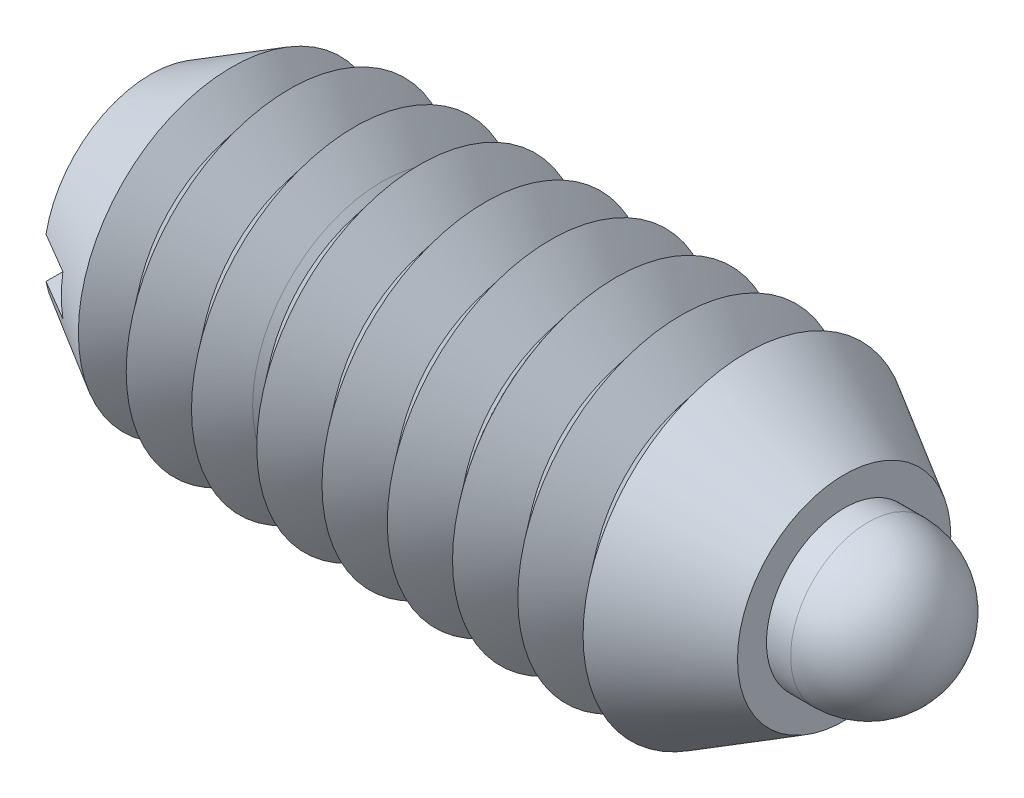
ISO-10303-21;
HEADER;
FILE_DESCRIPTION(('STEP AP214'),'2;1');
FILE_NAME('part.step','',(''),(''),'','','');
FILE_SCHEMA(('AUTOMOTIVE_DESIGN { 1 0 10303 214 1 1 1 1 }'));
ENDSEC;
DATA;
#1=APPLICATION_CONTEXT('core data for automotive mechanical design processes');
#2=APPLICATION_PROTOCOL_DEFINITION('international standard','automotive_design',2000,#1);
#3=PRODUCT_CONTEXT('',#1,'mechanical');
#4=PRODUCT('Part','Part','',(#3));
#5=PRODUCT_RELATED_PRODUCT_CATEGORY('part','',(#4));
#6=PRODUCT_DEFINITION_FORMATION('','',#4);
#7=PRODUCT_DEFINITION_CONTEXT('part definition',#1,'design');
#8=PRODUCT_DEFINITION('design','',#6,#7);
#9=PRODUCT_DEFINITION_SHAPE('','',#8);
#10=(LENGTH_UNIT() NAMED_UNIT(*) SI_UNIT(.MILLI.,.METRE.));
#11=(NAMED_UNIT(*) PLANE_ANGLE_UNIT() SI_UNIT($,.RADIAN.));
#12=(NAMED_UNIT(*) SI_UNIT($,.STERADIAN.) SOLID_ANGLE_UNIT());
#13=UNCERTAINTY_MEASURE_WITH_UNIT(LENGTH_MEASURE(1.E-05),#10,'distance_accuracy_value','');
#14=(GEOMETRIC_REPRESENTATION_CONTEXT(3) GLOBAL_UNCERTAINTY_ASSIGNED_CONTEXT((#13)) GLOBAL_UNIT_ASSIGNED_CONTEXT((#10,
#11,#12)) REPRESENTATION_CONTEXT('',''));
#15=CARTESIAN_POINT('',(0.,0.,0.));
#16=DIRECTION('',(0.,0.,1.));
#17=DIRECTION('',(1.,0.,0.));
#18=AXIS2_PLACEMENT_3D('',#15,#16,#17);
#19=CARTESIAN_POINT('',(10.01776,0.,0.));
#20=DIRECTION('',(-1.,0.,0.));
#21=DIRECTION('',(0.,-0.719424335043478,-0.694570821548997));
#22=AXIS2_PLACEMENT_3D('',#19,#20,#21);
#23=PLANE('',#22);
#24=CARTESIAN_POINT('',(10.01776,0.,0.));
#25=DIRECTION('',(1.,0.,0.));
#26=DIRECTION('',(0.,0.719424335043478,0.694570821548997));
#27=AXIS2_PLACEMENT_3D('',#24,#25,#26);
#28=CIRCLE('',#27,1.5113);
#29=CARTESIAN_POINT('',(10.01776,1.08726599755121,1.049704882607));
#30=VERTEX_POINT('',#29);
#31=EDGE_CURVE('P0_E10',#30,#30,#28,.T.);
#32=ORIENTED_EDGE('',*,*,#31,.F.);
#33=EDGE_LOOP('',(#32));
#34=FACE_BOUND('',#33,.T.);
#35=ADVANCED_FACE('P0_F14',(#34),#23,.T.);
#36=CARTESIAN_POINT('',(10.32002,0.,0.));
#37=DIRECTION('',(1.,0.,0.));
#38=DIRECTION('',(0.,0.719424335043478,0.694570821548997));
#39=AXIS2_PLACEMENT_3D('',#36,#37,#38);
#40=CONICAL_SURFACE('',#39,1.81356,0.78539816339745);
#41=ORIENTED_EDGE('',*,*,#31,.T.);
#42=EDGE_LOOP('',(#41));
#43=FACE_BOUND('',#42,.T.);
#44=CARTESIAN_POINT('',(10.32002,0.,0.));
#45=DIRECTION('',(1.,0.,0.));
#46=DIRECTION('',(0.,0.719424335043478,0.694570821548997));
#47=AXIS2_PLACEMENT_3D('',#44,#45,#46);
#48=CIRCLE('',#47,1.81356);
#49=CARTESIAN_POINT('',(10.32002,1.30471919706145,1.2596458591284));
#50=VERTEX_POINT('',#49);
#51=EDGE_CURVE('P0_E20',#50,#50,#48,.T.);
#52=ORIENTED_EDGE('',*,*,#51,.F.);
#53=EDGE_LOOP('',(#52));
#54=FACE_BOUND('',#53,.T.);
#55=ADVANCED_FACE('P0_F54',(#43,#54),#40,.T.);
#56=CARTESIAN_POINT('',(15.47495,0.,0.));
#57=DIRECTION('',(1.,0.,0.));
#58=DIRECTION('',(0.,0.719424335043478,0.694570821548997));
#59=AXIS2_PLACEMENT_3D('',#56,#57,#58);
#60=CYLINDRICAL_SURFACE('',#59,1.81356);
#61=ORIENTED_EDGE('',*,*,#51,.T.);
#62=EDGE_LOOP('',(#61));
#63=FACE_BOUND('',#62,.T.);
#64=CARTESIAN_POINT('',(12.5168303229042,0.,0.));
#65=DIRECTION('',(1.,0.,0.));
#66=DIRECTION('',(0.,0.719424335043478,0.694570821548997));
#67=AXIS2_PLACEMENT_3D('',#64,#65,#66);
#68=CIRCLE('',#67,1.81356);
#69=CARTESIAN_POINT('',(12.5168303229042,1.30471919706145,1.2596458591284));
#70=VERTEX_POINT('',#69);
#71=EDGE_CURVE('P0_E24',#70,#70,#68,.T.);
#72=ORIENTED_EDGE('',*,*,#71,.F.);
#73=EDGE_LOOP('',(#72));
#74=FACE_BOUND('',#73,.T.);
#75=ADVANCED_FACE('P0_F50',(#63,#74),#60,.T.);
#76=CARTESIAN_POINT('',(13.04036,0.,0.));
#77=DIRECTION('',(-1.,0.,0.));
#78=DIRECTION('',(0.,-0.719424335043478,-0.694570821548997));
#79=AXIS2_PLACEMENT_3D('',#76,#77,#78);
#80=CONICAL_SURFACE('',#79,1.5113,0.5235987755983);
#81=ORIENTED_EDGE('',*,*,#71,.T.);
#82=EDGE_LOOP('',(#81));
#83=FACE_BOUND('',#82,.T.);
#84=CARTESIAN_POINT('',(13.04036,0.,0.));
#85=DIRECTION('',(1.,0.,0.));
#86=DIRECTION('',(0.,0.719424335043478,0.694570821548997));
#87=AXIS2_PLACEMENT_3D('',#84,#85,#86);
#88=CIRCLE('',#87,1.5113);
#89=CARTESIAN_POINT('',(13.04036,1.08726599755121,1.049704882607));
#90=VERTEX_POINT('',#89);
#91=EDGE_CURVE('P0_E28',#90,#90,#88,.T.);
#92=ORIENTED_EDGE('',*,*,#91,.F.);
#93=EDGE_LOOP('',(#92));
#94=FACE_BOUND('',#93,.T.);
#95=ADVANCED_FACE('P0_F41',(#83,#94),#80,.T.);
#96=CARTESIAN_POINT('',(15.47495,0.,0.));
#97=DIRECTION('',(1.,0.,0.));
#98=DIRECTION('',(0.,0.719424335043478,0.694570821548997));
#99=AXIS2_PLACEMENT_3D('',#96,#97,#98);
#100=CYLINDRICAL_SURFACE('',#99,1.5113);
#101=ORIENTED_EDGE('',*,*,#91,.T.);
#102=EDGE_LOOP('',(#101));
#103=FACE_BOUND('',#102,.T.);
#104=CARTESIAN_POINT('',(13.96365,0.,0.));
#105=DIRECTION('',(1.,0.,0.));
#106=DIRECTION('',(0.,0.719424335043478,0.694570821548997));
#107=AXIS2_PLACEMENT_3D('',#104,#105,#106);
#108=CIRCLE('',#107,1.5113);
#109=CARTESIAN_POINT('',(13.96365,1.08726599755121,1.049704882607));
#110=VERTEX_POINT('',#109);
#111=EDGE_CURVE('P0_E33',#110,#110,#108,.T.);
#112=ORIENTED_EDGE('',*,*,#111,.F.);
#113=EDGE_LOOP('',(#112));
#114=FACE_BOUND('',#113,.T.);
#115=ADVANCED_FACE('P0_F39',(#103,#114),#100,.T.);
#116=CARTESIAN_POINT('',(13.96365,0.,0.));
#117=DIRECTION('',(1.,0.,0.));
#118=DIRECTION('',(0.,0.719424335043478,0.694570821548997));
#119=AXIS2_PLACEMENT_3D('',#116,#117,#118);
#120=SPHERICAL_SURFACE('',#119,1.5113);
#121=ORIENTED_EDGE('',*,*,#111,.T.);
#122=EDGE_LOOP('',(#121));
#123=FACE_BOUND('',#122,.T.);
#124=ADVANCED_FACE('P0_F37',(#123),#120,.T.);
#125=CLOSED_SHELL('',(#35,#55,#75,#95,#115,#124));
#126=MANIFOLD_SOLID_BREP('P0_B1',#125);
#127=CARTESIAN_POINT('',(4.49791666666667,6.35,-3.175));
#128=DIRECTION('',(-1.,0.,0.));
#129=DIRECTION('',(0.,-1.,0.));
#130=AXIS2_PLACEMENT_3D('',#127,#128,#129);
#131=PLANE('',#130);
#132=CARTESIAN_POINT('',(4.49791666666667,0.,0.));
#133=DIRECTION('',(-1.,0.,0.));
#134=DIRECTION('',(0.,-1.,0.));
#135=AXIS2_PLACEMENT_3D('',#132,#133,#134);
#136=CIRCLE('',#135,2.51407104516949);
#137=CARTESIAN_POINT('',(4.49791666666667,-2.51407104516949,0.));
#138=VERTEX_POINT('',#137);
#139=EDGE_CURVE('P1_E31',#138,#138,#136,.F.);
#140=ORIENTED_EDGE('',*,*,#139,.F.);
#141=EDGE_LOOP('',(#140));
#142=FACE_BOUND('',#141,.T.);
#143=CARTESIAN_POINT('',(4.49791666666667,0.,0.));
#144=DIRECTION('',(1.,0.,0.));
#145=DIRECTION('',(0.,0.,-1.));
#146=AXIS2_PLACEMENT_3D('',#143,#144,#145);
#147=CIRCLE('',#146,1.83896);
#148=CARTESIAN_POINT('',(4.49791666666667,0.,-1.83896));
#149=VERTEX_POINT('',#148);
#150=EDGE_CURVE('P1_E47',#149,#149,#147,.T.);
#151=ORIENTED_EDGE('',*,*,#150,.T.);
#152=EDGE_LOOP('',(#151));
#153=FACE_BOUND('',#152,.T.);
#154=ADVANCED_FACE('P1_F14',(#142,#153),#131,.T.);
#155=CARTESIAN_POINT('',(8.99583333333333,6.35,-3.175));
#156=DIRECTION('',(1.,0.,0.));
#157=DIRECTION('',(0.,1.,0.));
#158=AXIS2_PLACEMENT_3D('',#155,#156,#157);
#159=PLANE('',#158);
#160=CARTESIAN_POINT('',(8.99583333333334,0.,0.));
#161=DIRECTION('',(1.,0.,0.));
#162=DIRECTION('',(0.,1.,0.));
#163=AXIS2_PLACEMENT_3D('',#160,#161,#162);
#164=CIRCLE('',#163,3.10890710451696);
#165=CARTESIAN_POINT('',(8.99583333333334,3.10890710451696,0.));
#166=VERTEX_POINT('',#165);
#167=EDGE_CURVE('P1_E33',#166,#166,#164,.F.);
#168=ORIENTED_EDGE('',*,*,#167,.F.);
#169=EDGE_LOOP('',(#168));
#170=FACE_BOUND('',#169,.T.);
#171=CARTESIAN_POINT('',(8.99583333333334,0.,0.));
#172=DIRECTION('',(1.,0.,0.));
#173=DIRECTION('',(0.,1.,0.));
#174=AXIS2_PLACEMENT_3D('',#171,#172,#173);
#175=CIRCLE('',#174,1.83896);
#176=CARTESIAN_POINT('',(8.99583333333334,1.83896,0.));
#177=VERTEX_POINT('',#176);
#178=EDGE_CURVE('P1_E18',#177,#177,#175,.F.);
#179=ORIENTED_EDGE('',*,*,#178,.T.);
#180=EDGE_LOOP('',(#179));
#181=FACE_BOUND('',#180,.T.);
#182=ADVANCED_FACE('P1_F71',(#170,#181),#159,.T.);
#183=CARTESIAN_POINT('',(5.87374999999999,0.,0.));
#184=DIRECTION('',(1.,0.,0.));
#185=DIRECTION('',(0.,0.,-1.));
#186=AXIS2_PLACEMENT_3D('',#183,#184,#185);
#187=CONICAL_SURFACE('',#186,2.3818852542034,0.895664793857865);
#188=CARTESIAN_POINT('',(6.50874999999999,0.,0.));
#189=DIRECTION('',(-1.,0.,0.));
#190=DIRECTION('',(0.,0.,1.));
#191=AXIS2_PLACEMENT_3D('',#188,#189,#190);
#192=CIRCLE('',#191,3.175);
#193=CARTESIAN_POINT('',(6.50874999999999,0.,3.175));
#194=VERTEX_POINT('',#193);
#195=EDGE_CURVE('P1_E44',#194,#194,#192,.T.);
#196=ORIENTED_EDGE('',*,*,#195,.T.);
#197=EDGE_LOOP('',(#196));
#198=FACE_BOUND('',#197,.T.);
#199=CARTESIAN_POINT('',(5.87374999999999,0.,0.));
#200=DIRECTION('',(-1.,0.,0.));
#201=DIRECTION('',(0.,0.,1.));
#202=AXIS2_PLACEMENT_3D('',#199,#200,#201);
#203=CIRCLE('',#202,2.3818852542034);
#204=CARTESIAN_POINT('',(5.87374999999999,0.,2.3818852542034));
#205=VERTEX_POINT('',#204);
#206=EDGE_CURVE('P1_E51',#205,#205,#203,.T.);
#207=ORIENTED_EDGE('',*,*,#206,.F.);
#208=EDGE_LOOP('',(#207));
#209=FACE_BOUND('',#208,.T.);
#210=ADVANCED_FACE('P1_F77',(#198,#209),#187,.T.);
#211=CARTESIAN_POINT('',(5.23874999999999,0.,0.));
#212=DIRECTION('',(-1.,0.,0.));
#213=DIRECTION('',(0.,0.,1.));
#214=AXIS2_PLACEMENT_3D('',#211,#212,#213);
#215=CONICAL_SURFACE('',#214,3.175,0.895664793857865);
#216=ORIENTED_EDGE('',*,*,#206,.T.);
#217=EDGE_LOOP('',(#216));
#218=FACE_BOUND('',#217,.T.);
#219=CARTESIAN_POINT('',(5.23874999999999,0.,0.));
#220=DIRECTION('',(-1.,0.,0.));
#221=DIRECTION('',(0.,0.,1.));
#222=AXIS2_PLACEMENT_3D('',#219,#220,#221);
#223=CIRCLE('',#222,3.175);
#224=CARTESIAN_POINT('',(5.23874999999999,0.,3.175));
#225=VERTEX_POINT('',#224);
#226=EDGE_CURVE('P1_E35',#225,#225,#223,.T.);
#227=ORIENTED_EDGE('',*,*,#226,.F.);
#228=EDGE_LOOP('',(#227));
#229=FACE_BOUND('',#228,.T.);
#230=ADVANCED_FACE('P1_F91',(#218,#229),#215,.T.);
#231=CARTESIAN_POINT('',(4.60374999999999,0.,0.));
#232=DIRECTION('',(1.,0.,0.));
#233=DIRECTION('',(0.,0.,-1.));
#234=AXIS2_PLACEMENT_3D('',#231,#232,#233);
#235=CONICAL_SURFACE('',#234,2.3818852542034,0.895664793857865);
#236=ORIENTED_EDGE('',*,*,#226,.T.);
#237=EDGE_LOOP('',(#236));
#238=FACE_BOUND('',#237,.T.);
#239=CARTESIAN_POINT('',(4.60374999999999,0.,0.));
#240=DIRECTION('',(-1.,0.,0.));
#241=DIRECTION('',(0.,0.,1.));
#242=AXIS2_PLACEMENT_3D('',#239,#240,#241);
#243=CIRCLE('',#242,2.3818852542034);
#244=CARTESIAN_POINT('',(4.60374999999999,0.,2.3818852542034));
#245=VERTEX_POINT('',#244);
#246=EDGE_CURVE('P1_E39',#245,#245,#243,.T.);
#247=ORIENTED_EDGE('',*,*,#246,.F.);
#248=EDGE_LOOP('',(#247));
#249=FACE_BOUND('',#248,.T.);
#250=ADVANCED_FACE('P1_F87',(#238,#249),#235,.T.);
#251=CARTESIAN_POINT('',(3.96874999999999,0.,0.));
#252=DIRECTION('',(-1.,0.,0.));
#253=DIRECTION('',(0.,0.,1.));
#254=AXIS2_PLACEMENT_3D('',#251,#252,#253);
#255=CONICAL_SURFACE('',#254,3.175,0.895664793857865);
#256=ORIENTED_EDGE('',*,*,#246,.T.);
#257=EDGE_LOOP('',(#256));
#258=FACE_BOUND('',#257,.T.);
#259=ORIENTED_EDGE('',*,*,#139,.T.);
#260=EDGE_LOOP('',(#259));
#261=FACE_BOUND('',#260,.T.);
#262=ADVANCED_FACE('P1_F84',(#258,#261),#255,.T.);
#263=CARTESIAN_POINT('',(6.50874999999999,0.,0.));
#264=DIRECTION('',(-1.,0.,0.));
#265=DIRECTION('',(0.,0.,1.));
#266=AXIS2_PLACEMENT_3D('',#263,#264,#265);
#267=CONICAL_SURFACE('',#266,3.175,0.895664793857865);
#268=CARTESIAN_POINT('',(7.14374999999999,0.,0.));
#269=DIRECTION('',(-1.,0.,0.));
#270=DIRECTION('',(0.,0.,1.));
#271=AXIS2_PLACEMENT_3D('',#268,#269,#270);
#272=CIRCLE('',#271,2.3818852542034);
#273=CARTESIAN_POINT('',(7.14374999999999,0.,2.3818852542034));
#274=VERTEX_POINT('',#273);
#275=EDGE_CURVE('P1_E22',#274,#274,#272,.T.);
#276=ORIENTED_EDGE('',*,*,#275,.T.);
#277=EDGE_LOOP('',(#276));
#278=FACE_BOUND('',#277,.T.);
#279=ORIENTED_EDGE('',*,*,#195,.F.);
#280=EDGE_LOOP('',(#279));
#281=FACE_BOUND('',#280,.T.);
#282=ADVANCED_FACE('P1_F68',(#278,#281),#267,.T.);
#283=CARTESIAN_POINT('',(7.14374999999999,0.,0.));
#284=DIRECTION('',(1.,0.,0.));
#285=DIRECTION('',(0.,0.,-1.));
#286=AXIS2_PLACEMENT_3D('',#283,#284,#285);
#287=CONICAL_SURFACE('',#286,2.3818852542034,0.895664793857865);
#288=CARTESIAN_POINT('',(7.77874999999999,0.,0.));
#289=DIRECTION('',(-1.,0.,0.));
#290=DIRECTION('',(0.,0.,1.));
#291=AXIS2_PLACEMENT_3D('',#288,#289,#290);
#292=CIRCLE('',#291,3.175);
#293=CARTESIAN_POINT('',(7.77874999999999,0.,3.175));
#294=VERTEX_POINT('',#293);
#295=EDGE_CURVE('P1_E27',#294,#294,#292,.T.);
#296=ORIENTED_EDGE('',*,*,#295,.T.);
#297=EDGE_LOOP('',(#296));
#298=FACE_BOUND('',#297,.T.);
#299=ORIENTED_EDGE('',*,*,#275,.F.);
#300=EDGE_LOOP('',(#299));
#301=FACE_BOUND('',#300,.T.);
#302=ADVANCED_FACE('P1_F56',(#298,#301),#287,.T.);
#303=CARTESIAN_POINT('',(7.77874999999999,0.,0.));
#304=DIRECTION('',(-1.,0.,0.));
#305=DIRECTION('',(0.,0.,1.));
#306=AXIS2_PLACEMENT_3D('',#303,#304,#305);
#307=CONICAL_SURFACE('',#306,3.175,0.895664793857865);
#308=CARTESIAN_POINT('',(8.41374999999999,0.,0.));
#309=DIRECTION('',(-1.,0.,0.));
#310=DIRECTION('',(0.,0.,1.));
#311=AXIS2_PLACEMENT_3D('',#308,#309,#310);
#312=CIRCLE('',#311,2.3818852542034);
#313=CARTESIAN_POINT('',(8.41374999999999,0.,2.3818852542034));
#314=VERTEX_POINT('',#313);
#315=EDGE_CURVE('P1_E10',#314,#314,#312,.T.);
#316=ORIENTED_EDGE('',*,*,#315,.T.);
#317=EDGE_LOOP('',(#316));
#318=FACE_BOUND('',#317,.T.);
#319=ORIENTED_EDGE('',*,*,#295,.F.);
#320=EDGE_LOOP('',(#319));
#321=FACE_BOUND('',#320,.T.);
#322=ADVANCED_FACE('P1_F59',(#318,#321),#307,.T.);
#323=CARTESIAN_POINT('',(8.41374999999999,0.,0.));
#324=DIRECTION('',(1.,0.,0.));
#325=DIRECTION('',(0.,0.,-1.));
#326=AXIS2_PLACEMENT_3D('',#323,#324,#325);
#327=CONICAL_SURFACE('',#326,2.3818852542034,0.895664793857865);
#328=ORIENTED_EDGE('',*,*,#315,.F.);
#329=EDGE_LOOP('',(#328));
#330=FACE_BOUND('',#329,.T.);
#331=ORIENTED_EDGE('',*,*,#167,.T.);
#332=EDGE_LOOP('',(#331));
#333=FACE_BOUND('',#332,.T.);
#334=ADVANCED_FACE('P1_F16',(#330,#333),#327,.T.);
#335=CARTESIAN_POINT('',(13.49375,0.,0.));
#336=DIRECTION('',(-1.,0.,0.));
#337=DIRECTION('',(0.,0.,1.));
#338=AXIS2_PLACEMENT_3D('',#335,#336,#337);
#339=CYLINDRICAL_SURFACE('',#338,1.83896);
#340=ORIENTED_EDGE('',*,*,#178,.F.);
#341=EDGE_LOOP('',(#340));
#342=FACE_BOUND('',#341,.T.);
#343=ORIENTED_EDGE('',*,*,#150,.F.);
#344=EDGE_LOOP('',(#343));
#345=FACE_BOUND('',#344,.T.);
#346=ADVANCED_FACE('P1_F66',(#342,#345),#339,.F.);
#347=CLOSED_SHELL('',(#154,#182,#210,#230,#250,#262,#282,#302,#322,#334,#346));
#348=MANIFOLD_SOLID_BREP('P1_B1',#347);
#349=CARTESIAN_POINT('',(13.49375,0.,0.));
#350=DIRECTION('',(1.,0.,0.));
#351=DIRECTION('',(0.,0.,-1.));
#352=AXIS2_PLACEMENT_3D('',#349,#350,#351);
#353=PLANE('',#352);
#354=CARTESIAN_POINT('',(13.49375,0.,0.));
#355=DIRECTION('',(1.,0.,0.));
#356=DIRECTION('',(0.,0.,-1.));
#357=AXIS2_PLACEMENT_3D('',#354,#355,#356);
#358=CIRCLE('',#357,2.07514773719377);
#359=CARTESIAN_POINT('',(13.49375,0.,-2.07514773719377));
#360=VERTEX_POINT('',#359);
#361=EDGE_CURVE('P2_E79',#360,#360,#358,.T.);
#362=ORIENTED_EDGE('',*,*,#361,.T.);
#363=EDGE_LOOP('',(#362));
#364=FACE_BOUND('',#363,.T.);
#365=CARTESIAN_POINT('',(13.49375,0.,0.));
#366=DIRECTION('',(-1.,0.,0.));
#367=DIRECTION('',(0.,0.,1.));
#368=AXIS2_PLACEMENT_3D('',#365,#366,#367);
#369=CIRCLE('',#368,1.5113);
#370=CARTESIAN_POINT('',(13.49375,0.,1.5113));
#371=VERTEX_POINT('',#370);
#372=EDGE_CURVE('P2_E66',#371,#371,#369,.T.);
#373=ORIENTED_EDGE('',*,*,#372,.T.);
#374=EDGE_LOOP('',(#373));
#375=FACE_BOUND('',#374,.T.);
#376=ADVANCED_FACE('P2_F15',(#364,#375),#353,.T.);
#377=CARTESIAN_POINT('',(13.49375,0.,0.));
#378=DIRECTION('',(-1.,0.,0.));
#379=DIRECTION('',(0.,0.,1.));
#380=AXIS2_PLACEMENT_3D('',#377,#378,#379);
#381=CONICAL_SURFACE('',#380,2.07514773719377,0.523598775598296);
#382=CARTESIAN_POINT('',(11.58875,0.,0.));
#383=DIRECTION('',(-1.,0.,0.));
#384=DIRECTION('',(0.,0.,1.));
#385=AXIS2_PLACEMENT_3D('',#382,#383,#384);
#386=CIRCLE('',#385,3.175);
#387=CARTESIAN_POINT('',(11.58875,0.,3.175));
#388=VERTEX_POINT('',#387);
#389=EDGE_CURVE('P2_E147',#388,#388,#386,.T.);
#390=ORIENTED_EDGE('',*,*,#389,.F.);
#391=EDGE_LOOP('',(#390));
#392=FACE_BOUND('',#391,.T.);
#393=ORIENTED_EDGE('',*,*,#361,.F.);
#394=EDGE_LOOP('',(#393));
#395=FACE_BOUND('',#394,.T.);
#396=ADVANCED_FACE('P2_F17',(#392,#395),#381,.T.);
#397=CARTESIAN_POINT('',(0.,0.,0.));
#398=DIRECTION('',(-1.,0.,0.));
#399=DIRECTION('',(0.,0.,1.));
#400=AXIS2_PLACEMENT_3D('',#397,#398,#399);
#401=CYLINDRICAL_SURFACE('',#400,1.5113);
#402=CARTESIAN_POINT('',(13.04036,0.,0.));
#403=DIRECTION('',(-1.,0.,0.));
#404=DIRECTION('',(0.,0.,1.));
#405=AXIS2_PLACEMENT_3D('',#402,#403,#404);
#406=CIRCLE('',#405,1.5113);
#407=CARTESIAN_POINT('',(13.04036,0.,1.5113));
#408=VERTEX_POINT('',#407);
#409=EDGE_CURVE('P2_E159',#408,#408,#406,.T.);
#410=ORIENTED_EDGE('',*,*,#409,.T.);
#411=EDGE_LOOP('',(#410));
#412=FACE_BOUND('',#411,.T.);
#413=ORIENTED_EDGE('',*,*,#372,.F.);
#414=EDGE_LOOP('',(#413));
#415=FACE_BOUND('',#414,.T.);
#416=ADVANCED_FACE('P2_F182',(#412,#415),#401,.F.);
#417=CARTESIAN_POINT('',(13.04036,0.,0.));
#418=DIRECTION('',(-1.,0.,0.));
#419=DIRECTION('',(0.,0.,1.));
#420=AXIS2_PLACEMENT_3D('',#417,#418,#419);
#421=CONICAL_SURFACE('',#420,1.5113,0.785398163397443);
#422=CARTESIAN_POINT('',(12.7381,0.,0.));
#423=DIRECTION('',(-1.,0.,0.));
#424=DIRECTION('',(0.,0.,1.));
#425=AXIS2_PLACEMENT_3D('',#422,#423,#424);
#426=CIRCLE('',#425,1.81356);
#427=CARTESIAN_POINT('',(12.7381,0.,1.81356));
#428=VERTEX_POINT('',#427);
#429=EDGE_CURVE('P2_E156',#428,#428,#426,.T.);
#430=ORIENTED_EDGE('',*,*,#429,.T.);
#431=EDGE_LOOP('',(#430));
#432=FACE_BOUND('',#431,.T.);
#433=ORIENTED_EDGE('',*,*,#409,.F.);
#434=EDGE_LOOP('',(#433));
#435=FACE_BOUND('',#434,.T.);
#436=ADVANCED_FACE('P2_F189',(#432,#435),#421,.F.);
#437=CARTESIAN_POINT('',(0.,0.,0.));
#438=DIRECTION('',(-1.,0.,0.));
#439=DIRECTION('',(0.,0.,1.));
#440=AXIS2_PLACEMENT_3D('',#437,#438,#439);
#441=CYLINDRICAL_SURFACE('',#440,1.81356);
#442=CARTESIAN_POINT('',(2.38125,0.,0.));
#443=DIRECTION('',(-1.,0.,0.));
#444=DIRECTION('',(0.,0.,1.));
#445=AXIS2_PLACEMENT_3D('',#442,#443,#444);
#446=CIRCLE('',#445,1.81356);
#447=CARTESIAN_POINT('',(2.38125,0.,1.81356));
#448=VERTEX_POINT('',#447);
#449=EDGE_CURVE('P2_E153',#448,#448,#446,.T.);
#450=ORIENTED_EDGE('',*,*,#449,.T.);
#451=EDGE_LOOP('',(#450));
#452=FACE_BOUND('',#451,.T.);
#453=ORIENTED_EDGE('',*,*,#429,.F.);
#454=EDGE_LOOP('',(#453));
#455=FACE_BOUND('',#454,.T.);
#456=ADVANCED_FACE('P2_F194',(#452,#455),#441,.F.);
#457=CARTESIAN_POINT('',(2.38125,0.,0.));
#458=DIRECTION('',(1.,0.,0.));
#459=DIRECTION('',(0.,0.,-1.));
#460=AXIS2_PLACEMENT_3D('',#457,#458,#459);
#461=PLANE('',#460);
#462=ORIENTED_EDGE('',*,*,#449,.F.);
#463=EDGE_LOOP('',(#462));
#464=FACE_BOUND('',#463,.T.);
#465=ADVANCED_FACE('P2_F200',(#464),#461,.T.);
#466=CARTESIAN_POINT('',(10.95375,0.,0.));
#467=DIRECTION('',(1.,0.,0.));
#468=DIRECTION('',(0.,0.,-1.));
#469=AXIS2_PLACEMENT_3D('',#466,#467,#468);
#470=CONICAL_SURFACE('',#469,2.3818852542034,0.895664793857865);
#471=ORIENTED_EDGE('',*,*,#389,.T.);
#472=EDGE_LOOP('',(#471));
#473=FACE_BOUND('',#472,.T.);
#474=CARTESIAN_POINT('',(10.95375,0.,0.));
#475=DIRECTION('',(-1.,0.,0.));
#476=DIRECTION('',(0.,0.,1.));
#477=AXIS2_PLACEMENT_3D('',#474,#475,#476);
#478=CIRCLE('',#477,2.3818852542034);
#479=CARTESIAN_POINT('',(10.95375,0.,2.3818852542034));
#480=VERTEX_POINT('',#479);
#481=EDGE_CURVE('P2_E150',#480,#480,#478,.T.);
#482=ORIENTED_EDGE('',*,*,#481,.F.);
#483=EDGE_LOOP('',(#482));
#484=FACE_BOUND('',#483,.T.);
#485=ADVANCED_FACE('P2_F204',(#473,#484),#470,.T.);
#486=CARTESIAN_POINT('',(10.31875,0.,0.));
#487=DIRECTION('',(-1.,0.,0.));
#488=DIRECTION('',(0.,0.,1.));
#489=AXIS2_PLACEMENT_3D('',#486,#487,#488);
#490=CONICAL_SURFACE('',#489,3.175,0.895664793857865);
#491=ORIENTED_EDGE('',*,*,#481,.T.);
#492=EDGE_LOOP('',(#491));
#493=FACE_BOUND('',#492,.T.);
#494=CARTESIAN_POINT('',(10.31875,0.,0.));
#495=DIRECTION('',(-1.,0.,0.));
#496=DIRECTION('',(0.,0.,1.));
#497=AXIS2_PLACEMENT_3D('',#494,#495,#496);
#498=CIRCLE('',#497,3.175);
#499=CARTESIAN_POINT('',(10.31875,0.,3.175));
#500=VERTEX_POINT('',#499);
#501=EDGE_CURVE('P2_E141',#500,#500,#498,.T.);
#502=ORIENTED_EDGE('',*,*,#501,.F.);
#503=EDGE_LOOP('',(#502));
#504=FACE_BOUND('',#503,.T.);
#505=ADVANCED_FACE('P2_F208',(#493,#504),#490,.T.);
#506=CARTESIAN_POINT('',(9.68374999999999,0.,0.));
#507=DIRECTION('',(1.,0.,0.));
#508=DIRECTION('',(0.,0.,-1.));
#509=AXIS2_PLACEMENT_3D('',#506,#507,#508);
#510=CONICAL_SURFACE('',#509,2.3818852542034,0.895664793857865);
#511=ORIENTED_EDGE('',*,*,#501,.T.);
#512=EDGE_LOOP('',(#511));
#513=FACE_BOUND('',#512,.T.);
#514=CARTESIAN_POINT('',(9.68374999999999,0.,0.));
#515=DIRECTION('',(-1.,0.,0.));
#516=DIRECTION('',(0.,0.,1.));
#517=AXIS2_PLACEMENT_3D('',#514,#515,#516);
#518=CIRCLE('',#517,2.3818852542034);
#519=CARTESIAN_POINT('',(9.68374999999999,0.,2.3818852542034));
#520=VERTEX_POINT('',#519);
#521=EDGE_CURVE('P2_E144',#520,#520,#518,.T.);
#522=ORIENTED_EDGE('',*,*,#521,.F.);
#523=EDGE_LOOP('',(#522));
#524=FACE_BOUND('',#523,.T.);
#525=ADVANCED_FACE('P2_F212',(#513,#524),#510,.T.);
#526=CARTESIAN_POINT('',(9.04874999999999,0.,0.));
#527=DIRECTION('',(-1.,0.,0.));
#528=DIRECTION('',(0.,0.,1.));
#529=AXIS2_PLACEMENT_3D('',#526,#527,#528);
#530=CONICAL_SURFACE('',#529,3.175,0.895664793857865);
#531=ORIENTED_EDGE('',*,*,#521,.T.);
#532=EDGE_LOOP('',(#531));
#533=FACE_BOUND('',#532,.T.);
#534=CARTESIAN_POINT('',(9.04874999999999,0.,0.));
#535=DIRECTION('',(-1.,0.,0.));
#536=DIRECTION('',(0.,0.,1.));
#537=AXIS2_PLACEMENT_3D('',#534,#535,#536);
#538=CIRCLE('',#537,3.175);
#539=CARTESIAN_POINT('',(9.04874999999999,0.,3.175));
#540=VERTEX_POINT('',#539);
#541=EDGE_CURVE('P2_E138',#540,#540,#538,.T.);
#542=ORIENTED_EDGE('',*,*,#541,.F.);
#543=EDGE_LOOP('',(#542));
#544=FACE_BOUND('',#543,.T.);
#545=ADVANCED_FACE('P2_F216',(#533,#544),#530,.T.);
#546=CARTESIAN_POINT('',(8.41374999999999,0.,0.));
#547=DIRECTION('',(1.,0.,0.));
#548=DIRECTION('',(0.,0.,-1.));
#549=AXIS2_PLACEMENT_3D('',#546,#547,#548);
#550=CONICAL_SURFACE('',#549,2.3818852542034,0.895664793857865);
#551=CARTESIAN_POINT('',(8.99583333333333,0.,0.));
#552=DIRECTION('',(1.,0.,0.));
#553=DIRECTION('',(0.,0.,-1.));
#554=AXIS2_PLACEMENT_3D('',#551,#552,#553);
#555=CIRCLE('',#554,3.10890710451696);
#556=CARTESIAN_POINT('',(8.99583333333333,0.,-3.10890710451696));
#557=VERTEX_POINT('',#556);
#558=EDGE_CURVE('P2_E19',#557,#557,#555,.F.);
#559=ORIENTED_EDGE('',*,*,#558,.F.);
#560=EDGE_LOOP('',(#559));
#561=FACE_BOUND('',#560,.T.);
#562=ORIENTED_EDGE('',*,*,#541,.T.);
#563=EDGE_LOOP('',(#562));
#564=FACE_BOUND('',#563,.T.);
#565=ADVANCED_FACE('P2_F220',(#561,#564),#550,.T.);
#566=CARTESIAN_POINT('',(4.49791666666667,0.,0.));
#567=DIRECTION('',(1.,0.,0.));
#568=DIRECTION('',(0.,0.,-1.));
#569=AXIS2_PLACEMENT_3D('',#566,#567,#568);
#570=PLANE('',#569);
#571=CARTESIAN_POINT('',(4.49791666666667,0.,0.));
#572=DIRECTION('',(1.,0.,0.));
#573=DIRECTION('',(0.,0.,-1.));
#574=AXIS2_PLACEMENT_3D('',#571,#572,#573);
#575=CIRCLE('',#574,2.51407104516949);
#576=CARTESIAN_POINT('',(4.49791666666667,0.,-2.51407104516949));
#577=VERTEX_POINT('',#576);
#578=EDGE_CURVE('P2_E114',#577,#577,#575,.F.);
#579=ORIENTED_EDGE('',*,*,#578,.F.);
#580=EDGE_LOOP('',(#579));
#581=FACE_BOUND('',#580,.T.);
#582=CARTESIAN_POINT('',(4.49791666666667,0.,0.));
#583=DIRECTION('',(1.,0.,0.));
#584=DIRECTION('',(0.,0.,-1.));
#585=AXIS2_PLACEMENT_3D('',#582,#583,#584);
#586=CIRCLE('',#585,1.83896);
#587=CARTESIAN_POINT('',(4.49791666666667,0.,-1.83896));
#588=VERTEX_POINT('',#587);
#589=EDGE_CURVE('P2_E116',#588,#588,#586,.T.);
#590=ORIENTED_EDGE('',*,*,#589,.F.);
#591=EDGE_LOOP('',(#590));
#592=FACE_BOUND('',#591,.T.);
#593=ADVANCED_FACE('P2_F224',(#581,#592),#570,.T.);
#594=CARTESIAN_POINT('',(18.1175108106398,0.,0.));
#595=DIRECTION('',(-1.,0.,0.));
#596=DIRECTION('',(0.,0.,1.));
#597=AXIS2_PLACEMENT_3D('',#594,#595,#596);
#598=CYLINDRICAL_SURFACE('',#597,1.83896);
#599=ORIENTED_EDGE('',*,*,#589,.T.);
#600=EDGE_LOOP('',(#599));
#601=FACE_BOUND('',#600,.T.);
#602=CARTESIAN_POINT('',(8.99583333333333,0.,0.));
#603=DIRECTION('',(1.,0.,0.));
#604=DIRECTION('',(0.,0.,-1.));
#605=AXIS2_PLACEMENT_3D('',#602,#603,#604);
#606=CIRCLE('',#605,1.83896);
#607=CARTESIAN_POINT('',(8.99583333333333,0.,-1.83896));
#608=VERTEX_POINT('',#607);
#609=EDGE_CURVE('P2_E122',#608,#608,#606,.T.);
#610=ORIENTED_EDGE('',*,*,#609,.F.);
#611=EDGE_LOOP('',(#610));
#612=FACE_BOUND('',#611,.T.);
#613=ADVANCED_FACE('P2_F173',(#601,#612),#598,.T.);
#614=CARTESIAN_POINT('',(8.99583333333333,0.,0.));
#615=DIRECTION('',(1.,0.,0.));
#616=DIRECTION('',(0.,0.,-1.));
#617=AXIS2_PLACEMENT_3D('',#614,#615,#616);
#618=PLANE('',#617);
#619=ORIENTED_EDGE('',*,*,#558,.T.);
#620=EDGE_LOOP('',(#619));
#621=FACE_BOUND('',#620,.T.);
#622=ORIENTED_EDGE('',*,*,#609,.T.);
#623=EDGE_LOOP('',(#622));
#624=FACE_BOUND('',#623,.T.);
#625=ADVANCED_FACE('P2_F168',(#621,#624),#618,.F.);
#626=CARTESIAN_POINT('',(0.,0.,0.));
#627=DIRECTION('',(1.,0.,0.));
#628=DIRECTION('',(0.,0.,-1.));
#629=AXIS2_PLACEMENT_3D('',#626,#627,#628);
#630=PLANE('',#629);
#631=CARTESIAN_POINT('',(0.,0.,0.));
#632=DIRECTION('',(1.,0.,0.));
#633=DIRECTION('',(0.,0.,-1.));
#634=AXIS2_PLACEMENT_3D('',#631,#632,#633);
#635=CIRCLE('',#634,2.07514773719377);
#636=CARTESIAN_POINT('',(0.,-0.396875,-2.03684274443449));
#637=VERTEX_POINT('',#636);
#638=CARTESIAN_POINT('',(0.,-0.396875,2.03684274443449));
#639=VERTEX_POINT('',#638);
#640=EDGE_CURVE('P2_E75',#637,#639,#635,.F.);
#641=ORIENTED_EDGE('',*,*,#640,.T.);
#642=DIRECTION('',(0.,0.,1.));
#643=VECTOR('',#642,1.);
#644=CARTESIAN_POINT('',(0.,-0.396875,-3.175));
#645=LINE('',#644,#643);
#646=EDGE_CURVE('P2_E33',#637,#639,#645,.T.);
#647=ORIENTED_EDGE('',*,*,#646,.F.);
#648=EDGE_LOOP('',(#641,#647));
#649=FACE_BOUND('',#648,.T.);
#650=ADVANCED_FACE('P2_F101',(#649),#630,.F.);
#651=CARTESIAN_POINT('',(0.,-0.396875,-3.175));
#652=DIRECTION('',(0.,-1.,0.));
#653=DIRECTION('',(0.,0.,-1.));
#654=AXIS2_PLACEMENT_3D('',#651,#652,#653);
#655=PLANE('',#654);
#656=CARTESIAN_POINT('',(4.63360025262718,-0.396875,-4.73375033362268));
#657=CARTESIAN_POINT('',(4.40225577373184,-0.396875,-4.59971325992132));
#658=CARTESIAN_POINT('',(4.1709270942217,-0.396875,-4.46564886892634));
#659=CARTESIAN_POINT('',(3.70831487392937,-0.396875,-4.19744166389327));
#660=CARTESIAN_POINT('',(3.47703133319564,-0.396875,-4.06329884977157));
#661=CARTESIAN_POINT('',(2.78317868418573,-0.396875,-3.66066483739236));
#662=CARTESIAN_POINT('',(2.32069838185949,-0.396875,-3.39202067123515));
#663=CARTESIAN_POINT('',(1.40822725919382,-0.396875,-2.86099325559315));
#664=CARTESIAN_POINT('',(0.958225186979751,-0.396875,-2.59862938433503));
#665=CARTESIAN_POINT('',(0.284033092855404,-0.396875,-2.20378597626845));
#666=CARTESIAN_POINT('',(0.0594566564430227,-0.396875,-2.07196652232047));
#667=CARTESIAN_POINT('',(-0.389242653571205,-0.396875,-1.80755883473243));
#668=CARTESIAN_POINT('',(-0.613365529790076,-0.396875,-1.67497060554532));
#669=CARTESIAN_POINT('',(-0.949483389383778,-0.396875,-1.47457737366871));
#670=CARTESIAN_POINT('',(-1.06181776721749,-0.396875,-1.40734242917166));
#671=CARTESIAN_POINT('',(-1.28616598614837,-0.396875,-1.27225327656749));
#672=CARTESIAN_POINT('',(-1.39817970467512,-0.396875,-1.20439886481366));
#673=CARTESIAN_POINT('',(-1.62279263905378,-0.396875,-1.06704407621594));
#674=CARTESIAN_POINT('',(-1.73538591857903,-0.396875,-0.997533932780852));
#675=CARTESIAN_POINT('',(-1.90340740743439,-0.396875,-0.892004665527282));
#676=CARTESIAN_POINT('',(-1.9592429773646,-0.396875,-0.856635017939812));
#677=CARTESIAN_POINT('',(-2.07051796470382,-0.396875,-0.785280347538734));
#678=CARTESIAN_POINT('',(-2.12595739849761,-0.396875,-0.749295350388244));
#679=CARTESIAN_POINT('',(-2.2362867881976,-0.396875,-0.676389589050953));
#680=CARTESIAN_POINT('',(-2.29117623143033,-0.396875,-0.639468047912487));
#681=CARTESIAN_POINT('',(-2.4001507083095,-0.396875,-0.564119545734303));
#682=CARTESIAN_POINT('',(-2.45423312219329,-0.396875,-0.525688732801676));
#683=CARTESIAN_POINT('',(-2.53374291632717,-0.396875,-0.466412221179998));
#684=CARTESIAN_POINT('',(-2.55985195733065,-0.396875,-0.446484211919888));
#685=CARTESIAN_POINT('',(-2.61141791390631,-0.396875,-0.405805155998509));
#686=CARTESIAN_POINT('',(-2.63687497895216,-0.396875,-0.385054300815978));
#687=CARTESIAN_POINT('',(-2.68669748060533,-0.396875,-0.342480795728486));
#688=CARTESIAN_POINT('',(-2.71106704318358,-0.396875,-0.3206629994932));
#689=CARTESIAN_POINT('',(-2.75819349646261,-0.396875,-0.27536409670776));
#690=CARTESIAN_POINT('',(-2.78095296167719,-0.396875,-0.251885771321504));
#691=CARTESIAN_POINT('',(-2.8098915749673,-0.396875,-0.218235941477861));
#692=CARTESIAN_POINT('',(-2.81735218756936,-0.396875,-0.209175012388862));
#693=CARTESIAN_POINT('',(-2.83177709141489,-0.396875,-0.190664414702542));
#694=CARTESIAN_POINT('',(-2.83874115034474,-0.396875,-0.181214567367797));
#695=CARTESIAN_POINT('',(-2.85864241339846,-0.396875,-0.152259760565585));
#696=CARTESIAN_POINT('',(-2.87065924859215,-0.396875,-0.132071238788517));
#697=CARTESIAN_POINT('',(-2.88661762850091,-0.396875,-0.0978105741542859));
#698=CARTESIAN_POINT('',(-2.89188802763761,-0.396875,-0.0843674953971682));
#699=CARTESIAN_POINT('',(-2.90024255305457,-0.396875,-0.0568103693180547));
#700=CARTESIAN_POINT('',(-2.90332959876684,-0.396875,-0.0426972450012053));
#701=CARTESIAN_POINT('',(-2.90687418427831,-0.396875,-0.0140056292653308));
#702=CARTESIAN_POINT('',(-2.90730892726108,-0.396875,0.00057581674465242));
#703=CARTESIAN_POINT('',(-2.90540833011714,-0.396875,0.0295529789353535));
#704=CARTESIAN_POINT('',(-2.90307176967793,-0.396875,0.0439486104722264));
#705=CARTESIAN_POINT('',(-2.89527474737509,-0.396875,0.0750736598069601));
#706=CARTESIAN_POINT('',(-2.88926238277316,-0.396875,0.0916601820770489));
#707=CARTESIAN_POINT('',(-2.87473923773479,-0.396875,0.12370226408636));
#708=CARTESIAN_POINT('',(-2.86622089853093,-0.396875,0.139154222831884));
#709=CARTESIAN_POINT('',(-2.84475357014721,-0.396875,0.173406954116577));
#710=CARTESIAN_POINT('',(-2.83123942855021,-0.396875,0.191845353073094));
#711=CARTESIAN_POINT('',(-2.80250837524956,-0.396875,0.227363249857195));
#712=CARTESIAN_POINT('',(-2.78728772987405,-0.396875,0.244439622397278));
#713=CARTESIAN_POINT('',(-2.75566122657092,-0.396875,0.277670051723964));
#714=CARTESIAN_POINT('',(-2.73924790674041,-0.396875,0.293816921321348));
#715=CARTESIAN_POINT('',(-2.7057045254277,-0.396875,0.325300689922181));
#716=CARTESIAN_POINT('',(-2.68857527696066,-0.396875,0.340638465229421));
#717=CARTESIAN_POINT('',(-2.63260406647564,-0.396875,0.389073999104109));
#718=CARTESIAN_POINT('',(-2.59276503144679,-0.396875,0.421012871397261));
#719=CARTESIAN_POINT('',(-2.51178428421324,-0.396875,0.483204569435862));
#720=CARTESIAN_POINT('',(-2.47064172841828,-0.396875,0.513456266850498));
#721=CARTESIAN_POINT('',(-2.38748526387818,-0.396875,0.572917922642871));
#722=CARTESIAN_POINT('',(-2.34546974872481,-0.396875,0.602125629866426));
#723=CARTESIAN_POINT('',(-2.26093919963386,-0.396875,0.659776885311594));
#724=CARTESIAN_POINT('',(-2.21842431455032,-0.396875,0.688220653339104));
#725=CARTESIAN_POINT('',(-2.09053542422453,-0.396875,0.772641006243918));
#726=CARTESIAN_POINT('',(-2.0046417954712,-0.396875,0.827828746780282));
#727=CARTESIAN_POINT('',(-1.83222051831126,-0.396875,0.936966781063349));
#728=CARTESIAN_POINT('',(-1.74569373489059,-0.396875,0.990918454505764));
#729=CARTESIAN_POINT('',(-1.5726941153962,-0.396875,1.09776741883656));
#730=CARTESIAN_POINT('',(-1.48622395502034,-0.396875,1.15066904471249));
#731=CARTESIAN_POINT('',(-1.31298674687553,-0.396875,1.2559843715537));
#732=CARTESIAN_POINT('',(-1.22621969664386,-0.396875,1.30839806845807));
#733=CARTESIAN_POINT('',(-0.965609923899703,-0.396875,1.46513773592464));
#734=CARTESIAN_POINT('',(-0.791463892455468,-0.396875,1.56895903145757));
#735=CARTESIAN_POINT('',(-0.442653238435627,-0.396875,1.77592898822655));
#736=CARTESIAN_POINT('',(-0.26798839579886,-0.396875,1.8790772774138));
#737=CARTESIAN_POINT('',(0.0816044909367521,-0.396875,2.08492026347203));
#738=CARTESIAN_POINT('',(0.256532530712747,-0.396875,2.18761496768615));
#739=CARTESIAN_POINT('',(0.781352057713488,-0.396875,2.49514176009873));
#740=CARTESIAN_POINT('',(1.13149514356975,-0.396875,2.69954416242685));
#741=CARTESIAN_POINT('',(1.83205333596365,-0.396875,3.1077624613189));
#742=CARTESIAN_POINT('',(2.18246839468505,-0.396875,3.31157844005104));
#743=CARTESIAN_POINT('',(2.70793364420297,-0.396875,3.61688242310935));
#744=CARTESIAN_POINT('',(2.88291239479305,-0.396875,3.71849339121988));
#745=CARTESIAN_POINT('',(3.23291385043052,-0.396875,3.9216545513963));
#746=CARTESIAN_POINT('',(3.4079365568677,-0.396875,4.0232047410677));
#747=CARTESIAN_POINT('',(3.75805566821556,-0.396875,4.22627967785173));
#748=CARTESIAN_POINT('',(3.93315208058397,-0.396875,4.32780441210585));
#749=CARTESIAN_POINT('',(4.28336260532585,-0.396875,4.53080829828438));
#750=CARTESIAN_POINT('',(4.45847671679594,-0.396875,4.63228745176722));
#751=CARTESIAN_POINT('',(4.63360025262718,-0.396875,4.73375033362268));
#752=B_SPLINE_CURVE_WITH_KNOTS('',3,(#656,#657,#658,#659,#660,#661,#662,#663,#664,#665,#666,
#667,#668,#669,#670,#671,#672,#673,#674,#675,#676,#677,#678,#679,#680,#681,#682,#683,#684,#685,
#686,#687,#688,#689,#690,#691,#692,#693,#694,#695,#696,#697,#698,#699,#700,#701,#702,#703,#704,
#705,#706,#707,#708,#709,#710,#711,#712,#713,#714,#715,#716,#717,#718,#719,#720,#721,#722,#723,
#724,#725,#726,#727,#728,#729,#730,#731,#732,#733,#734,#735,#736,#737,#738,#739,#740,#741,#742,
#743,#744,#745,#746,#747,#748,#749,#750,#751),.UNSPECIFIED.,.F.,.F.,(4,2,2,2,2,2,2,2,2,2,2,2,2,
2,2,2,2,2,2,2,2,2,2,2,2,2,2,2,2,2,2,2,2,2,2,2,2,2,2,2,2,2,2,2,2,2,2,4),(0.,0.802107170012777,
1.6042151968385,3.20874614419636,4.77144330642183,5.5526588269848,6.33386982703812,
6.72662278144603,7.11950986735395,7.51646266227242,7.71474692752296,7.91302294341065,
8.11146920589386,8.31045985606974,8.40898503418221,8.50748741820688,8.60557719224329,
8.70350640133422,8.73870120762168,8.77391237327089,8.84401998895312,8.88720004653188,
8.93032225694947,8.97381459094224,9.01732608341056,9.06995318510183,9.12274068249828,
9.19115130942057,9.25971464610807,9.32875167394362,9.39771232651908,9.55079557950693,
9.7039800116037,9.85747695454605,10.0109292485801,10.3171929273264,10.6230962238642,
10.9272003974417,11.2313070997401,11.8395391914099,12.4480830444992,13.0566170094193,
14.2729317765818,15.4890668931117,16.0960933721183,16.7031423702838,17.3103443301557,
17.9175236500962),.UNSPECIFIED.);
#753=CARTESIAN_POINT('',(0.79375,-0.396875,-2.50214001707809));
#754=VERTEX_POINT('',#753);
#755=EDGE_CURVE('P2_E92',#754,#637,#752,.T.);
#756=ORIENTED_EDGE('',*,*,#755,.T.);
#757=ORIENTED_EDGE('',*,*,#646,.T.);
#758=CARTESIAN_POINT('',(0.79375,-0.396875,2.50214001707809));
#759=VERTEX_POINT('',#758);
#760=EDGE_CURVE('P2_E86',#639,#759,#752,.T.);
#761=ORIENTED_EDGE('',*,*,#760,.T.);
#762=DIRECTION('',(0.,0.,1.));
#763=VECTOR('',#762,1.);
#764=CARTESIAN_POINT('',(0.79375,-0.396875,-3.175));
#765=LINE('',#764,#763);
#766=EDGE_CURVE('P2_E80',#754,#759,#765,.T.);
#767=ORIENTED_EDGE('',*,*,#766,.F.);
#768=EDGE_LOOP('',(#756,#757,#761,#767));
#769=FACE_BOUND('',#768,.T.);
#770=ADVANCED_FACE('P2_F95',(#769),#655,.F.);
#771=CARTESIAN_POINT('',(0.79375,0.396875,-3.175));
#772=DIRECTION('',(1.,0.,0.));
#773=DIRECTION('',(0.,0.,-1.));
#774=AXIS2_PLACEMENT_3D('',#771,#772,#773);
#775=PLANE('',#774);
#776=CARTESIAN_POINT('',(0.79375,0.,0.));
#777=DIRECTION('',(1.,0.,0.));
#778=DIRECTION('',(0.,0.,-1.));
#779=AXIS2_PLACEMENT_3D('',#776,#777,#778);
#780=CIRCLE('',#779,2.53341951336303);
#781=CARTESIAN_POINT('',(0.79375,0.396875,2.50214001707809));
#782=VERTEX_POINT('',#781);
#783=EDGE_CURVE('P2_E41',#759,#782,#780,.F.);
#784=ORIENTED_EDGE('',*,*,#783,.T.);
#785=DIRECTION('',(0.,0.,1.));
#786=VECTOR('',#785,1.);
#787=CARTESIAN_POINT('',(0.79375,0.396875,-3.175));
#788=LINE('',#787,#786);
#789=CARTESIAN_POINT('',(0.79375,0.396875,-2.50214001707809));
#790=VERTEX_POINT('',#789);
#791=EDGE_CURVE('P2_E76',#790,#782,#788,.T.);
#792=ORIENTED_EDGE('',*,*,#791,.F.);
#793=EDGE_CURVE('P2_E24',#790,#754,#780,.F.);
#794=ORIENTED_EDGE('',*,*,#793,.T.);
#795=ORIENTED_EDGE('',*,*,#766,.T.);
#796=EDGE_LOOP('',(#784,#792,#794,#795));
#797=FACE_BOUND('',#796,.T.);
#798=ADVANCED_FACE('P2_F100',(#797),#775,.F.);
#799=CARTESIAN_POINT('',(0.,0.396875,2.03684274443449));
#800=VERTEX_POINT('',#799);
#801=CARTESIAN_POINT('',(0.,0.396875,-2.03684274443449));
#802=VERTEX_POINT('',#801);
#803=EDGE_CURVE('P2_E72',#800,#802,#635,.F.);
#804=ORIENTED_EDGE('',*,*,#803,.T.);
#805=DIRECTION('',(0.,0.,1.));
#806=VECTOR('',#805,1.);
#807=CARTESIAN_POINT('',(0.,0.396875,-3.175));
#808=LINE('',#807,#806);
#809=EDGE_CURVE('P2_E59',#802,#800,#808,.T.);
#810=ORIENTED_EDGE('',*,*,#809,.T.);
#811=EDGE_LOOP('',(#804,#810));
#812=FACE_BOUND('',#811,.T.);
#813=ADVANCED_FACE('P2_F74',(#812),#630,.F.);
#814=CARTESIAN_POINT('',(0.,0.396875,-3.175));
#815=DIRECTION('',(0.,1.,0.));
#816=DIRECTION('',(0.,0.,1.));
#817=AXIS2_PLACEMENT_3D('',#814,#815,#816);
#818=PLANE('',#817);
#819=CARTESIAN_POINT('',(4.63360025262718,0.396875,4.73375033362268));
#820=CARTESIAN_POINT('',(4.40225577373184,0.396875,4.59971325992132));
#821=CARTESIAN_POINT('',(4.1709270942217,0.396875,4.46564886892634));
#822=CARTESIAN_POINT('',(3.70831487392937,0.396875,4.19744166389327));
#823=CARTESIAN_POINT('',(3.47703133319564,0.396875,4.06329884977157));
#824=CARTESIAN_POINT('',(2.78317868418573,0.396875,3.66066483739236));
#825=CARTESIAN_POINT('',(2.32069838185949,0.396875,3.39202067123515));
#826=CARTESIAN_POINT('',(1.40822725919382,0.396875,2.86099325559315));
#827=CARTESIAN_POINT('',(0.958225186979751,0.396875,2.59862938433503));
#828=CARTESIAN_POINT('',(0.284033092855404,0.396875,2.20378597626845));
#829=CARTESIAN_POINT('',(0.0594566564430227,0.396875,2.07196652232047));
#830=CARTESIAN_POINT('',(-0.389242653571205,0.396875,1.80755883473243));
#831=CARTESIAN_POINT('',(-0.613365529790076,0.396875,1.67497060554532));
#832=CARTESIAN_POINT('',(-0.949483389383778,0.396875,1.47457737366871));
#833=CARTESIAN_POINT('',(-1.06181776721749,0.396875,1.40734242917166));
#834=CARTESIAN_POINT('',(-1.28616598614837,0.396875,1.27225327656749));
#835=CARTESIAN_POINT('',(-1.39817970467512,0.396875,1.20439886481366));
#836=CARTESIAN_POINT('',(-1.62279263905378,0.396875,1.06704407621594));
#837=CARTESIAN_POINT('',(-1.73538591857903,0.396875,0.997533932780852));
#838=CARTESIAN_POINT('',(-1.90340740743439,0.396875,0.892004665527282));
#839=CARTESIAN_POINT('',(-1.9592429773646,0.396875,0.856635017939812));
#840=CARTESIAN_POINT('',(-2.07051796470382,0.396875,0.785280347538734));
#841=CARTESIAN_POINT('',(-2.12595739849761,0.396875,0.749295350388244));
#842=CARTESIAN_POINT('',(-2.2362867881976,0.396875,0.676389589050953));
#843=CARTESIAN_POINT('',(-2.29117623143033,0.396875,0.639468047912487));
#844=CARTESIAN_POINT('',(-2.4001507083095,0.396875,0.564119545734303));
#845=CARTESIAN_POINT('',(-2.45423312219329,0.396875,0.525688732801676));
#846=CARTESIAN_POINT('',(-2.53374291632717,0.396875,0.466412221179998));
#847=CARTESIAN_POINT('',(-2.55985195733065,0.396875,0.446484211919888));
#848=CARTESIAN_POINT('',(-2.61141791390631,0.396875,0.405805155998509));
#849=CARTESIAN_POINT('',(-2.63687497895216,0.396875,0.385054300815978));
#850=CARTESIAN_POINT('',(-2.68669748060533,0.396875,0.342480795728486));
#851=CARTESIAN_POINT('',(-2.71106704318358,0.396875,0.3206629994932));
#852=CARTESIAN_POINT('',(-2.75819349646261,0.396875,0.27536409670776));
#853=CARTESIAN_POINT('',(-2.78095296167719,0.396875,0.251885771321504));
#854=CARTESIAN_POINT('',(-2.8098915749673,0.396875,0.218235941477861));
#855=CARTESIAN_POINT('',(-2.81735218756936,0.396875,0.209175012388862));
#856=CARTESIAN_POINT('',(-2.83177709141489,0.396875,0.190664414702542));
#857=CARTESIAN_POINT('',(-2.83874115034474,0.396875,0.181214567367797));
#858=CARTESIAN_POINT('',(-2.85864241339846,0.396875,0.152259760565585));
#859=CARTESIAN_POINT('',(-2.87065924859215,0.396875,0.132071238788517));
#860=CARTESIAN_POINT('',(-2.88661762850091,0.396875,0.0978105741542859));
#861=CARTESIAN_POINT('',(-2.89188802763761,0.396875,0.0843674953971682));
#862=CARTESIAN_POINT('',(-2.90024255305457,0.396875,0.0568103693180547));
#863=CARTESIAN_POINT('',(-2.90332959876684,0.396875,0.0426972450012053));
#864=CARTESIAN_POINT('',(-2.90687418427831,0.396875,0.0140056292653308));
#865=CARTESIAN_POINT('',(-2.90730892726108,0.396875,-0.00057581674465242));
#866=CARTESIAN_POINT('',(-2.90540833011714,0.396875,-0.0295529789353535));
#867=CARTESIAN_POINT('',(-2.90307176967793,0.396875,-0.0439486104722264));
#868=CARTESIAN_POINT('',(-2.89527474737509,0.396875,-0.0750736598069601));
#869=CARTESIAN_POINT('',(-2.88926238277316,0.396875,-0.0916601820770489));
#870=CARTESIAN_POINT('',(-2.87473923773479,0.396875,-0.12370226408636));
#871=CARTESIAN_POINT('',(-2.86622089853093,0.396875,-0.139154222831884));
#872=CARTESIAN_POINT('',(-2.84475357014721,0.396875,-0.173406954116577));
#873=CARTESIAN_POINT('',(-2.83123942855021,0.396875,-0.191845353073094));
#874=CARTESIAN_POINT('',(-2.80250837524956,0.396875,-0.227363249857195));
#875=CARTESIAN_POINT('',(-2.78728772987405,0.396875,-0.244439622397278));
#876=CARTESIAN_POINT('',(-2.75566122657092,0.396875,-0.277670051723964));
#877=CARTESIAN_POINT('',(-2.73924790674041,0.396875,-0.293816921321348));
#878=CARTESIAN_POINT('',(-2.7057045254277,0.396875,-0.325300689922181));
#879=CARTESIAN_POINT('',(-2.68857527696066,0.396875,-0.340638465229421));
#880=CARTESIAN_POINT('',(-2.63260406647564,0.396875,-0.389073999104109));
#881=CARTESIAN_POINT('',(-2.59276503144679,0.396875,-0.421012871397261));
#882=CARTESIAN_POINT('',(-2.51178428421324,0.396875,-0.483204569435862));
#883=CARTESIAN_POINT('',(-2.47064172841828,0.396875,-0.513456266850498));
#884=CARTESIAN_POINT('',(-2.38748526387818,0.396875,-0.572917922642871));
#885=CARTESIAN_POINT('',(-2.34546974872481,0.396875,-0.602125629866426));
#886=CARTESIAN_POINT('',(-2.26093919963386,0.396875,-0.659776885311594));
#887=CARTESIAN_POINT('',(-2.21842431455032,0.396875,-0.688220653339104));
#888=CARTESIAN_POINT('',(-2.09053542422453,0.396875,-0.772641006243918));
#889=CARTESIAN_POINT('',(-2.0046417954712,0.396875,-0.827828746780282));
#890=CARTESIAN_POINT('',(-1.83222051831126,0.396875,-0.936966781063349));
#891=CARTESIAN_POINT('',(-1.74569373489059,0.396875,-0.990918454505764));
#892=CARTESIAN_POINT('',(-1.5726941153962,0.396875,-1.09776741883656));
#893=CARTESIAN_POINT('',(-1.48622395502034,0.396875,-1.15066904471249));
#894=CARTESIAN_POINT('',(-1.31298674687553,0.396875,-1.2559843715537));
#895=CARTESIAN_POINT('',(-1.22621969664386,0.396875,-1.30839806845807));
#896=CARTESIAN_POINT('',(-0.965609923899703,0.396875,-1.46513773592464));
#897=CARTESIAN_POINT('',(-0.791463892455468,0.396875,-1.56895903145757));
#898=CARTESIAN_POINT('',(-0.442653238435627,0.396875,-1.77592898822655));
#899=CARTESIAN_POINT('',(-0.26798839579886,0.396875,-1.8790772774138));
#900=CARTESIAN_POINT('',(0.0816044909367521,0.396875,-2.08492026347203));
#901=CARTESIAN_POINT('',(0.256532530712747,0.396875,-2.18761496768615));
#902=CARTESIAN_POINT('',(0.781352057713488,0.396875,-2.49514176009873));
#903=CARTESIAN_POINT('',(1.13149514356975,0.396875,-2.69954416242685));
#904=CARTESIAN_POINT('',(1.83205333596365,0.396875,-3.1077624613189));
#905=CARTESIAN_POINT('',(2.18246839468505,0.396875,-3.31157844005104));
#906=CARTESIAN_POINT('',(2.70793364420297,0.396875,-3.61688242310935));
#907=CARTESIAN_POINT('',(2.88291239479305,0.396875,-3.71849339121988));
#908=CARTESIAN_POINT('',(3.23291385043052,0.396875,-3.9216545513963));
#909=CARTESIAN_POINT('',(3.4079365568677,0.396875,-4.0232047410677));
#910=CARTESIAN_POINT('',(3.75805566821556,0.396875,-4.22627967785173));
#911=CARTESIAN_POINT('',(3.93315208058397,0.396875,-4.32780441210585));
#912=CARTESIAN_POINT('',(4.28336260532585,0.396875,-4.53080829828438));
#913=CARTESIAN_POINT('',(4.45847671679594,0.396875,-4.63228745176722));
#914=CARTESIAN_POINT('',(4.63360025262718,0.396875,-4.73375033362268));
#915=B_SPLINE_CURVE_WITH_KNOTS('',3,(#819,#820,#821,#822,#823,#824,#825,#826,#827,#828,#829,
#830,#831,#832,#833,#834,#835,#836,#837,#838,#839,#840,#841,#842,#843,#844,#845,#846,#847,#848,
#849,#850,#851,#852,#853,#854,#855,#856,#857,#858,#859,#860,#861,#862,#863,#864,#865,#866,#867,
#868,#869,#870,#871,#872,#873,#874,#875,#876,#877,#878,#879,#880,#881,#882,#883,#884,#885,#886,
#887,#888,#889,#890,#891,#892,#893,#894,#895,#896,#897,#898,#899,#900,#901,#902,#903,#904,#905,
#906,#907,#908,#909,#910,#911,#912,#913,#914),.UNSPECIFIED.,.F.,.F.,(4,2,2,2,2,2,2,2,2,2,2,2,2,
2,2,2,2,2,2,2,2,2,2,2,2,2,2,2,2,2,2,2,2,2,2,2,2,2,2,2,2,2,2,2,2,2,2,4),(0.,0.802107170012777,
1.6042151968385,3.20874614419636,4.77144330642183,5.5526588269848,6.33386982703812,
6.72662278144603,7.11950986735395,7.51646266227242,7.71474692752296,7.91302294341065,
8.11146920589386,8.31045985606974,8.40898503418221,8.50748741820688,8.60557719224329,
8.70350640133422,8.73870120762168,8.77391237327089,8.84401998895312,8.88720004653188,
8.93032225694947,8.97381459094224,9.01732608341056,9.06995318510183,9.12274068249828,
9.19115130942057,9.25971464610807,9.32875167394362,9.39771232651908,9.55079557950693,
9.7039800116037,9.85747695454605,10.0109292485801,10.3171929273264,10.6230962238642,
10.9272003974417,11.2313070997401,11.8395391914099,12.4480830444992,13.0566170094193,
14.2729317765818,15.4890668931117,16.0960933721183,16.7031423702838,17.3103443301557,
17.9175236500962),.UNSPECIFIED.);
#916=EDGE_CURVE('P2_E26',#782,#800,#915,.T.);
#917=ORIENTED_EDGE('',*,*,#916,.T.);
#918=ORIENTED_EDGE('',*,*,#809,.F.);
#919=EDGE_CURVE('P2_E10',#802,#790,#915,.T.);
#920=ORIENTED_EDGE('',*,*,#919,.T.);
#921=ORIENTED_EDGE('',*,*,#791,.T.);
#922=EDGE_LOOP('',(#917,#918,#920,#921));
#923=FACE_BOUND('',#922,.T.);
#924=ADVANCED_FACE('P2_F61',(#923),#818,.F.);
#925=CARTESIAN_POINT('',(1.90500000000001,0.,0.));
#926=DIRECTION('',(1.,0.,0.));
#927=DIRECTION('',(0.,0.,-1.));
#928=AXIS2_PLACEMENT_3D('',#925,#926,#927);
#929=CONICAL_SURFACE('',#928,3.175,0.523598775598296);
#930=ORIENTED_EDGE('',*,*,#919,.F.);
#931=ORIENTED_EDGE('',*,*,#803,.F.);
#932=ORIENTED_EDGE('',*,*,#916,.F.);
#933=ORIENTED_EDGE('',*,*,#783,.F.);
#934=ORIENTED_EDGE('',*,*,#760,.F.);
#935=ORIENTED_EDGE('',*,*,#640,.F.);
#936=ORIENTED_EDGE('',*,*,#755,.F.);
#937=ORIENTED_EDGE('',*,*,#793,.F.);
#938=EDGE_LOOP('',(#930,#931,#932,#933,#934,#935,#936,#937));
#939=FACE_BOUND('',#938,.T.);
#940=CARTESIAN_POINT('',(1.57930333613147,0.,0.));
#941=DIRECTION('',(-1.,0.,0.));
#942=DIRECTION('',(0.,0.,1.));
#943=AXIS2_PLACEMENT_3D('',#940,#941,#942);
#944=CIRCLE('',#943,2.98695894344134);
#945=CARTESIAN_POINT('',(1.57930333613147,0.,2.98695894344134));
#946=VERTEX_POINT('',#945);
#947=EDGE_CURVE('P2_E110',#946,#946,#944,.T.);
#948=ORIENTED_EDGE('',*,*,#947,.T.);
#949=EDGE_LOOP('',(#948));
#950=FACE_BOUND('',#949,.T.);
#951=ADVANCED_FACE('P2_F70',(#939,#950),#929,.T.);
#952=CARTESIAN_POINT('',(1.42874999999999,0.,0.));
#953=DIRECTION('',(-1.,0.,0.));
#954=DIRECTION('',(0.,0.,1.));
#955=AXIS2_PLACEMENT_3D('',#952,#953,#954);
#956=CONICAL_SURFACE('',#955,3.175,0.895664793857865);
#957=ORIENTED_EDGE('',*,*,#947,.F.);
#958=EDGE_LOOP('',(#957));
#959=FACE_BOUND('',#958,.T.);
#960=CARTESIAN_POINT('',(2.06374999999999,0.,0.));
#961=DIRECTION('',(-1.,0.,0.));
#962=DIRECTION('',(0.,0.,1.));
#963=AXIS2_PLACEMENT_3D('',#960,#961,#962);
#964=CIRCLE('',#963,2.3818852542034);
#965=CARTESIAN_POINT('',(2.06374999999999,0.,2.3818852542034));
#966=VERTEX_POINT('',#965);
#967=EDGE_CURVE('P2_E113',#966,#966,#964,.T.);
#968=ORIENTED_EDGE('',*,*,#967,.T.);
#969=EDGE_LOOP('',(#968));
#970=FACE_BOUND('',#969,.T.);
#971=ADVANCED_FACE('P2_F241',(#959,#970),#956,.T.);
#972=CARTESIAN_POINT('',(2.06374999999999,0.,0.));
#973=DIRECTION('',(1.,0.,0.));
#974=DIRECTION('',(0.,0.,-1.));
#975=AXIS2_PLACEMENT_3D('',#972,#973,#974);
#976=CONICAL_SURFACE('',#975,2.3818852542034,0.895664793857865);
#977=CARTESIAN_POINT('',(2.69874999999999,0.,0.));
#978=DIRECTION('',(-1.,0.,0.));
#979=DIRECTION('',(0.,0.,1.));
#980=AXIS2_PLACEMENT_3D('',#977,#978,#979);
#981=CIRCLE('',#980,3.175);
#982=CARTESIAN_POINT('',(2.69874999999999,0.,3.175));
#983=VERTEX_POINT('',#982);
#984=EDGE_CURVE('P2_E120',#983,#983,#981,.T.);
#985=ORIENTED_EDGE('',*,*,#984,.T.);
#986=EDGE_LOOP('',(#985));
#987=FACE_BOUND('',#986,.T.);
#988=ORIENTED_EDGE('',*,*,#967,.F.);
#989=EDGE_LOOP('',(#988));
#990=FACE_BOUND('',#989,.T.);
#991=ADVANCED_FACE('P2_F237',(#987,#990),#976,.T.);
#992=CARTESIAN_POINT('',(2.69874999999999,0.,0.));
#993=DIRECTION('',(-1.,0.,0.));
#994=DIRECTION('',(0.,0.,1.));
#995=AXIS2_PLACEMENT_3D('',#992,#993,#994);
#996=CONICAL_SURFACE('',#995,3.175,0.895664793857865);
#997=CARTESIAN_POINT('',(3.33374999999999,0.,0.));
#998=DIRECTION('',(-1.,0.,0.));
#999=DIRECTION('',(0.,0.,1.));
#1000=AXIS2_PLACEMENT_3D('',#997,#998,#999);
#1001=CIRCLE('',#1000,2.3818852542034);
#1002=CARTESIAN_POINT('',(3.33374999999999,0.,2.3818852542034));
#1003=VERTEX_POINT('',#1002);
#1004=EDGE_CURVE('P2_E135',#1003,#1003,#1001,.T.);
#1005=ORIENTED_EDGE('',*,*,#1004,.T.);
#1006=EDGE_LOOP('',(#1005));
#1007=FACE_BOUND('',#1006,.T.);
#1008=ORIENTED_EDGE('',*,*,#984,.F.);
#1009=EDGE_LOOP('',(#1008));
#1010=FACE_BOUND('',#1009,.T.);
#1011=ADVANCED_FACE('P2_F233',(#1007,#1010),#996,.T.);
#1012=CARTESIAN_POINT('',(3.33374999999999,0.,0.));
#1013=DIRECTION('',(1.,0.,0.));
#1014=DIRECTION('',(0.,0.,-1.));
#1015=AXIS2_PLACEMENT_3D('',#1012,#1013,#1014);
#1016=CONICAL_SURFACE('',#1015,2.3818852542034,0.895664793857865);
#1017=CARTESIAN_POINT('',(3.96874999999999,0.,0.));
#1018=DIRECTION('',(-1.,0.,0.));
#1019=DIRECTION('',(0.,0.,1.));
#1020=AXIS2_PLACEMENT_3D('',#1017,#1018,#1019);
#1021=CIRCLE('',#1020,3.175);
#1022=CARTESIAN_POINT('',(3.96874999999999,0.,3.175));
#1023=VERTEX_POINT('',#1022);
#1024=EDGE_CURVE('P2_E112',#1023,#1023,#1021,.T.);
#1025=ORIENTED_EDGE('',*,*,#1024,.T.);
#1026=EDGE_LOOP('',(#1025));
#1027=FACE_BOUND('',#1026,.T.);
#1028=ORIENTED_EDGE('',*,*,#1004,.F.);
#1029=EDGE_LOOP('',(#1028));
#1030=FACE_BOUND('',#1029,.T.);
#1031=ADVANCED_FACE('P2_F229',(#1027,#1030),#1016,.T.);
#1032=CARTESIAN_POINT('',(3.96874999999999,0.,0.));
#1033=DIRECTION('',(-1.,0.,0.));
#1034=DIRECTION('',(0.,0.,1.));
#1035=AXIS2_PLACEMENT_3D('',#1032,#1033,#1034);
#1036=CONICAL_SURFACE('',#1035,3.175,0.895664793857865);
#1037=ORIENTED_EDGE('',*,*,#1024,.F.);
#1038=EDGE_LOOP('',(#1037));
#1039=FACE_BOUND('',#1038,.T.);
#1040=ORIENTED_EDGE('',*,*,#578,.T.);
#1041=EDGE_LOOP('',(#1040));
#1042=FACE_BOUND('',#1041,.T.);
#1043=ADVANCED_FACE('P2_F226',(#1039,#1042),#1036,.T.);
#1044=CLOSED_SHELL('',(#376,#396,#416,#436,#456,#465,#485,#505,#525,#545,#565,#593,#613,#625,
#650,#770,#798,#813,#924,#951,#971,#991,#1011,#1031,#1043));
#1045=MANIFOLD_SOLID_BREP('P2_B1',#1044);
#1046=ADVANCED_BREP_SHAPE_REPRESENTATION('',(#18,#126,#348,#1045),#14);
#1047=SHAPE_DEFINITION_REPRESENTATION(#9,#1046);
ENDSEC;
END-ISO-10303-21;
